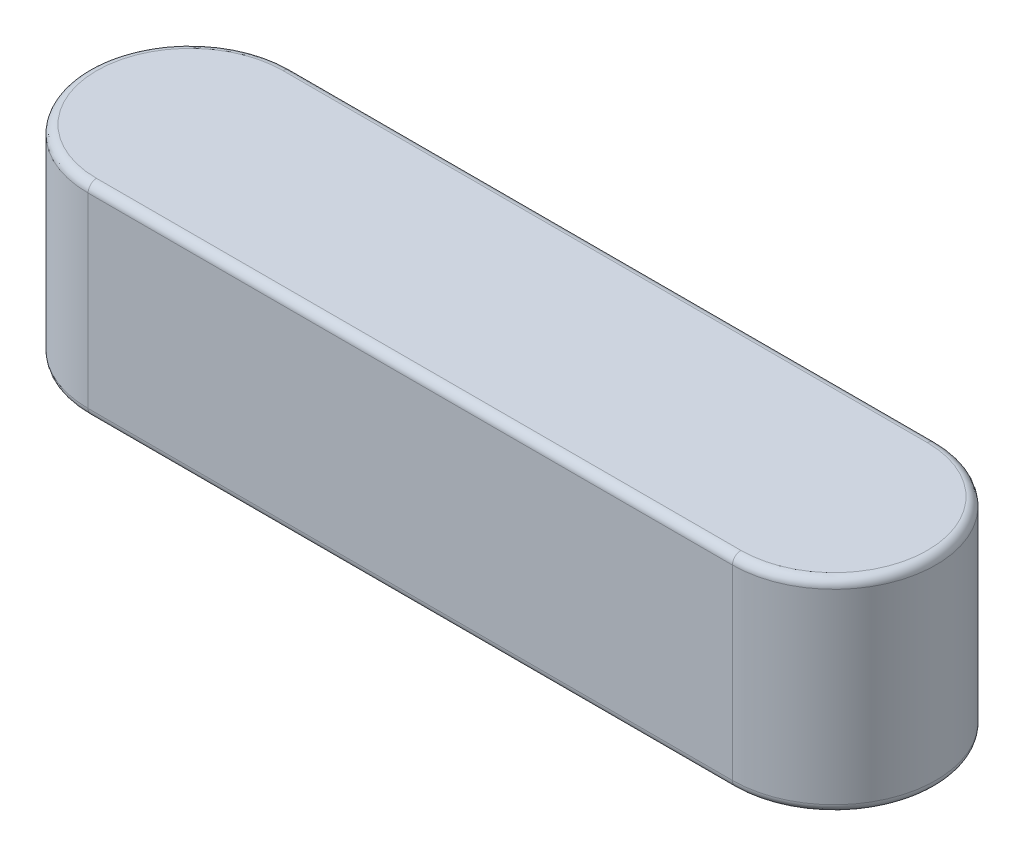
ISO-10303-21;
HEADER;
FILE_DESCRIPTION(('STEP AP214'),'2;1');
FILE_NAME('part.step','',(''),(''),'','','');
FILE_SCHEMA(('AUTOMOTIVE_DESIGN { 1 0 10303 214 1 1 1 1 }'));
ENDSEC;
DATA;
#1=APPLICATION_CONTEXT('core data for automotive mechanical design processes');
#2=APPLICATION_PROTOCOL_DEFINITION('international standard','automotive_design',2000,#1);
#3=PRODUCT_CONTEXT('',#1,'mechanical');
#4=PRODUCT('Part','Part','',(#3));
#5=PRODUCT_RELATED_PRODUCT_CATEGORY('part','',(#4));
#6=PRODUCT_DEFINITION_FORMATION('','',#4);
#7=PRODUCT_DEFINITION_CONTEXT('part definition',#1,'design');
#8=PRODUCT_DEFINITION('design','',#6,#7);
#9=PRODUCT_DEFINITION_SHAPE('','',#8);
#10=(LENGTH_UNIT() NAMED_UNIT(*) SI_UNIT(.MILLI.,.METRE.));
#11=(NAMED_UNIT(*) PLANE_ANGLE_UNIT() SI_UNIT($,.RADIAN.));
#12=(NAMED_UNIT(*) SI_UNIT($,.STERADIAN.) SOLID_ANGLE_UNIT());
#13=UNCERTAINTY_MEASURE_WITH_UNIT(LENGTH_MEASURE(1.E-05),#10,'distance_accuracy_value','');
#14=(GEOMETRIC_REPRESENTATION_CONTEXT(3) GLOBAL_UNCERTAINTY_ASSIGNED_CONTEXT((#13)) GLOBAL_UNIT_ASSIGNED_CONTEXT((#10,
#11,#12)) REPRESENTATION_CONTEXT('',''));
#15=CARTESIAN_POINT('',(0.,0.,0.));
#16=DIRECTION('',(0.,0.,1.));
#17=DIRECTION('',(1.,0.,0.));
#18=AXIS2_PLACEMENT_3D('',#15,#16,#17);
#19=CARTESIAN_POINT('',(-19.,6.,0.));
#20=DIRECTION('',(0.,-1.,0.));
#21=DIRECTION('',(0.,0.,-1.));
#22=AXIS2_PLACEMENT_3D('',#19,#20,#21);
#23=CYLINDRICAL_SURFACE('',#22,3.);
#24=DIRECTION('',(0.,-1.,0.));
#25=VECTOR('',#24,1.);
#26=CARTESIAN_POINT('',(-19.,6.,-3.));
#27=LINE('',#26,#25);
#28=CARTESIAN_POINT('',(-19.,5.75,-3.));
#29=VERTEX_POINT('',#28);
#30=CARTESIAN_POINT('',(-19.,0.25,-3.));
#31=VERTEX_POINT('',#30);
#32=EDGE_CURVE('E109',#29,#31,#27,.T.);
#33=ORIENTED_EDGE('',*,*,#32,.T.);
#34=CARTESIAN_POINT('',(-19.,0.25,0.));
#35=DIRECTION('',(0.,1.,0.));
#36=DIRECTION('',(0.,0.,1.));
#37=AXIS2_PLACEMENT_3D('',#34,#35,#36);
#38=CIRCLE('',#37,3.);
#39=CARTESIAN_POINT('',(-19.,0.25,3.));
#40=VERTEX_POINT('',#39);
#41=EDGE_CURVE('E120',#31,#40,#38,.T.);
#42=ORIENTED_EDGE('',*,*,#41,.T.);
#43=DIRECTION('',(0.,-1.,0.));
#44=VECTOR('',#43,1.);
#45=CARTESIAN_POINT('',(-19.,6.,3.));
#46=LINE('',#45,#44);
#47=CARTESIAN_POINT('',(-19.,5.75,3.));
#48=VERTEX_POINT('',#47);
#49=EDGE_CURVE('E115',#48,#40,#46,.T.);
#50=ORIENTED_EDGE('',*,*,#49,.F.);
#51=CARTESIAN_POINT('',(-19.,5.75,0.));
#52=DIRECTION('',(0.,1.,0.));
#53=DIRECTION('',(0.,0.,1.));
#54=AXIS2_PLACEMENT_3D('',#51,#52,#53);
#55=CIRCLE('',#54,3.);
#56=EDGE_CURVE('E108',#48,#29,#55,.F.);
#57=ORIENTED_EDGE('',*,*,#56,.T.);
#58=EDGE_LOOP('',(#33,#42,#50,#57));
#59=FACE_BOUND('',#58,.T.);
#60=ADVANCED_FACE('F39',(#59),#23,.T.);
#61=CARTESIAN_POINT('',(-19.,6.,3.));
#62=DIRECTION('',(0.,0.,-1.));
#63=DIRECTION('',(-1.,0.,0.));
#64=AXIS2_PLACEMENT_3D('',#61,#62,#63);
#65=PLANE('',#64);
#66=ORIENTED_EDGE('',*,*,#49,.T.);
#67=DIRECTION('',(1.,0.,0.));
#68=VECTOR('',#67,1.);
#69=CARTESIAN_POINT('',(-19.,0.25,3.));
#70=LINE('',#69,#68);
#71=CARTESIAN_POINT('',(0.,0.25,3.));
#72=VERTEX_POINT('',#71);
#73=EDGE_CURVE('E163',#40,#72,#70,.T.);
#74=ORIENTED_EDGE('',*,*,#73,.T.);
#75=DIRECTION('',(0.,-1.,0.));
#76=VECTOR('',#75,1.);
#77=CARTESIAN_POINT('',(0.,6.,3.));
#78=LINE('',#77,#76);
#79=CARTESIAN_POINT('',(0.,5.75,3.));
#80=VERTEX_POINT('',#79);
#81=EDGE_CURVE('E145',#80,#72,#78,.T.);
#82=ORIENTED_EDGE('',*,*,#81,.F.);
#83=DIRECTION('',(1.,0.,0.));
#84=VECTOR('',#83,1.);
#85=CARTESIAN_POINT('',(-19.,5.75,3.));
#86=LINE('',#85,#84);
#87=EDGE_CURVE('E156',#80,#48,#86,.F.);
#88=ORIENTED_EDGE('',*,*,#87,.T.);
#89=EDGE_LOOP('',(#66,#74,#82,#88));
#90=FACE_BOUND('',#89,.T.);
#91=ADVANCED_FACE('F190',(#90),#65,.F.);
#92=CARTESIAN_POINT('',(0.,6.,0.));
#93=DIRECTION('',(0.,-1.,0.));
#94=DIRECTION('',(0.,0.,-1.));
#95=AXIS2_PLACEMENT_3D('',#92,#93,#94);
#96=CYLINDRICAL_SURFACE('',#95,3.);
#97=ORIENTED_EDGE('',*,*,#81,.T.);
#98=CARTESIAN_POINT('',(0.,0.25,0.));
#99=DIRECTION('',(0.,1.,0.));
#100=DIRECTION('',(0.,0.,1.));
#101=AXIS2_PLACEMENT_3D('',#98,#99,#100);
#102=CIRCLE('',#101,3.);
#103=CARTESIAN_POINT('',(0.,0.25,-3.));
#104=VERTEX_POINT('',#103);
#105=EDGE_CURVE('E117',#72,#104,#102,.T.);
#106=ORIENTED_EDGE('',*,*,#105,.T.);
#107=DIRECTION('',(0.,-1.,0.));
#108=VECTOR('',#107,1.);
#109=CARTESIAN_POINT('',(0.,6.,-3.));
#110=LINE('',#109,#108);
#111=CARTESIAN_POINT('',(0.,5.75,-3.));
#112=VERTEX_POINT('',#111);
#113=EDGE_CURVE('E128',#112,#104,#110,.T.);
#114=ORIENTED_EDGE('',*,*,#113,.F.);
#115=CARTESIAN_POINT('',(0.,5.75,0.));
#116=DIRECTION('',(0.,1.,0.));
#117=DIRECTION('',(0.,0.,1.));
#118=AXIS2_PLACEMENT_3D('',#115,#116,#117);
#119=CIRCLE('',#118,3.);
#120=EDGE_CURVE('E154',#112,#80,#119,.F.);
#121=ORIENTED_EDGE('',*,*,#120,.T.);
#122=EDGE_LOOP('',(#97,#106,#114,#121));
#123=FACE_BOUND('',#122,.T.);
#124=ADVANCED_FACE('F184',(#123),#96,.T.);
#125=CARTESIAN_POINT('',(-19.,6.,-3.));
#126=DIRECTION('',(0.,0.,1.));
#127=DIRECTION('',(1.,0.,0.));
#128=AXIS2_PLACEMENT_3D('',#125,#126,#127);
#129=PLANE('',#128);
#130=ORIENTED_EDGE('',*,*,#113,.T.);
#131=DIRECTION('',(-1.,0.,0.));
#132=VECTOR('',#131,1.);
#133=CARTESIAN_POINT('',(-19.,0.25,-3.));
#134=LINE('',#133,#132);
#135=EDGE_CURVE('E127',#104,#31,#134,.T.);
#136=ORIENTED_EDGE('',*,*,#135,.T.);
#137=ORIENTED_EDGE('',*,*,#32,.F.);
#138=DIRECTION('',(-1.,0.,0.));
#139=VECTOR('',#138,1.);
#140=CARTESIAN_POINT('',(0.,5.75,-3.));
#141=LINE('',#140,#139);
#142=EDGE_CURVE('E123',#29,#112,#141,.F.);
#143=ORIENTED_EDGE('',*,*,#142,.T.);
#144=EDGE_LOOP('',(#130,#136,#137,#143));
#145=FACE_BOUND('',#144,.T.);
#146=ADVANCED_FACE('F124',(#145),#129,.F.);
#147=CARTESIAN_POINT('',(-19.,6.,0.));
#148=DIRECTION('',(0.,1.,0.));
#149=DIRECTION('',(0.,0.,1.));
#150=AXIS2_PLACEMENT_3D('',#147,#148,#149);
#151=PLANE('',#150);
#152=DIRECTION('',(1.,0.,0.));
#153=VECTOR('',#152,1.);
#154=CARTESIAN_POINT('',(0.,6.,2.75));
#155=LINE('',#154,#153);
#156=CARTESIAN_POINT('',(-19.,6.,2.75));
#157=VERTEX_POINT('',#156);
#158=CARTESIAN_POINT('',(0.,6.,2.75));
#159=VERTEX_POINT('',#158);
#160=EDGE_CURVE('E48',#157,#159,#155,.T.);
#161=ORIENTED_EDGE('',*,*,#160,.T.);
#162=CARTESIAN_POINT('',(0.,6.,0.));
#163=DIRECTION('',(0.,1.,0.));
#164=DIRECTION('',(0.,0.,1.));
#165=AXIS2_PLACEMENT_3D('',#162,#163,#164);
#166=CIRCLE('',#165,2.75);
#167=CARTESIAN_POINT('',(0.,6.,-2.75));
#168=VERTEX_POINT('',#167);
#169=EDGE_CURVE('E11',#159,#168,#166,.T.);
#170=ORIENTED_EDGE('',*,*,#169,.T.);
#171=DIRECTION('',(-1.,0.,0.));
#172=VECTOR('',#171,1.);
#173=CARTESIAN_POINT('',(-19.,6.,-2.75));
#174=LINE('',#173,#172);
#175=CARTESIAN_POINT('',(-19.,6.,-2.75));
#176=VERTEX_POINT('',#175);
#177=EDGE_CURVE('E165',#168,#176,#174,.T.);
#178=ORIENTED_EDGE('',*,*,#177,.T.);
#179=CARTESIAN_POINT('',(-19.,6.,0.));
#180=DIRECTION('',(0.,1.,0.));
#181=DIRECTION('',(0.,0.,1.));
#182=AXIS2_PLACEMENT_3D('',#179,#180,#181);
#183=CIRCLE('',#182,2.75);
#184=EDGE_CURVE('E132',#176,#157,#183,.T.);
#185=ORIENTED_EDGE('',*,*,#184,.T.);
#186=EDGE_LOOP('',(#161,#170,#178,#185));
#187=FACE_BOUND('',#186,.T.);
#188=ADVANCED_FACE('F208',(#187),#151,.T.);
#189=CARTESIAN_POINT('',(-19.,0.,0.));
#190=DIRECTION('',(0.,1.,0.));
#191=DIRECTION('',(0.,0.,1.));
#192=AXIS2_PLACEMENT_3D('',#189,#190,#191);
#193=PLANE('',#192);
#194=CARTESIAN_POINT('',(-19.,0.,0.));
#195=DIRECTION('',(0.,1.,0.));
#196=DIRECTION('',(0.,0.,1.));
#197=AXIS2_PLACEMENT_3D('',#194,#195,#196);
#198=CIRCLE('',#197,2.75);
#199=CARTESIAN_POINT('',(-19.,0.,2.75));
#200=VERTEX_POINT('',#199);
#201=CARTESIAN_POINT('',(-19.,0.,-2.75));
#202=VERTEX_POINT('',#201);
#203=EDGE_CURVE('E150',#200,#202,#198,.F.);
#204=ORIENTED_EDGE('',*,*,#203,.T.);
#205=DIRECTION('',(-1.,0.,0.));
#206=VECTOR('',#205,1.);
#207=CARTESIAN_POINT('',(-19.,0.,-2.75));
#208=LINE('',#207,#206);
#209=CARTESIAN_POINT('',(0.,0.,-2.75));
#210=VERTEX_POINT('',#209);
#211=EDGE_CURVE('E153',#202,#210,#208,.F.);
#212=ORIENTED_EDGE('',*,*,#211,.T.);
#213=CARTESIAN_POINT('',(0.,0.,0.));
#214=DIRECTION('',(0.,1.,0.));
#215=DIRECTION('',(0.,0.,1.));
#216=AXIS2_PLACEMENT_3D('',#213,#214,#215);
#217=CIRCLE('',#216,2.75);
#218=CARTESIAN_POINT('',(0.,0.,2.75));
#219=VERTEX_POINT('',#218);
#220=EDGE_CURVE('E148',#210,#219,#217,.F.);
#221=ORIENTED_EDGE('',*,*,#220,.T.);
#222=DIRECTION('',(1.,0.,0.));
#223=VECTOR('',#222,1.);
#224=CARTESIAN_POINT('',(-19.,0.,2.75));
#225=LINE('',#224,#223);
#226=EDGE_CURVE('E138',#219,#200,#225,.F.);
#227=ORIENTED_EDGE('',*,*,#226,.T.);
#228=EDGE_LOOP('',(#204,#212,#221,#227));
#229=FACE_BOUND('',#228,.T.);
#230=ADVANCED_FACE('F206',(#229),#193,.F.);
#231=CARTESIAN_POINT('',(-19.,0.25,2.75));
#232=DIRECTION('',(1.,0.,0.));
#233=DIRECTION('',(0.,0.,-1.));
#234=AXIS2_PLACEMENT_3D('',#231,#232,#233);
#235=CYLINDRICAL_SURFACE('',#234,0.25);
#236=CARTESIAN_POINT('',(-19.,0.25,2.75));
#237=DIRECTION('',(-1.,0.,0.));
#238=DIRECTION('',(0.,0.,1.));
#239=AXIS2_PLACEMENT_3D('',#236,#237,#238);
#240=CIRCLE('',#239,0.25);
#241=EDGE_CURVE('E171',#200,#40,#240,.T.);
#242=ORIENTED_EDGE('',*,*,#241,.F.);
#243=ORIENTED_EDGE('',*,*,#226,.F.);
#244=CARTESIAN_POINT('',(0.,0.25,2.75));
#245=DIRECTION('',(1.,0.,0.));
#246=DIRECTION('',(0.,0.,-1.));
#247=AXIS2_PLACEMENT_3D('',#244,#245,#246);
#248=CIRCLE('',#247,0.25);
#249=EDGE_CURVE('E129',#72,#219,#248,.T.);
#250=ORIENTED_EDGE('',*,*,#249,.F.);
#251=ORIENTED_EDGE('',*,*,#73,.F.);
#252=EDGE_LOOP('',(#242,#243,#250,#251));
#253=FACE_BOUND('',#252,.T.);
#254=ADVANCED_FACE('F203',(#253),#235,.T.);
#255=CARTESIAN_POINT('',(0.,0.25,0.));
#256=DIRECTION('',(0.,1.,0.));
#257=DIRECTION('',(0.,0.,1.));
#258=AXIS2_PLACEMENT_3D('',#255,#256,#257);
#259=TOROIDAL_SURFACE('',#258,2.75,0.25);
#260=ORIENTED_EDGE('',*,*,#249,.T.);
#261=ORIENTED_EDGE('',*,*,#220,.F.);
#262=CARTESIAN_POINT('',(0.,0.25,-2.75));
#263=DIRECTION('',(-1.,0.,0.));
#264=DIRECTION('',(0.,0.,1.));
#265=AXIS2_PLACEMENT_3D('',#262,#263,#264);
#266=CIRCLE('',#265,0.25);
#267=EDGE_CURVE('E169',#104,#210,#266,.T.);
#268=ORIENTED_EDGE('',*,*,#267,.F.);
#269=ORIENTED_EDGE('',*,*,#105,.F.);
#270=EDGE_LOOP('',(#260,#261,#268,#269));
#271=FACE_BOUND('',#270,.T.);
#272=ADVANCED_FACE('F193',(#271),#259,.T.);
#273=CARTESIAN_POINT('',(-19.,0.25,0.));
#274=DIRECTION('',(0.,1.,0.));
#275=DIRECTION('',(0.,0.,1.));
#276=AXIS2_PLACEMENT_3D('',#273,#274,#275);
#277=TOROIDAL_SURFACE('',#276,2.75,0.25);
#278=ORIENTED_EDGE('',*,*,#241,.T.);
#279=ORIENTED_EDGE('',*,*,#41,.F.);
#280=CARTESIAN_POINT('',(-19.,0.25,-2.75));
#281=DIRECTION('',(1.,0.,0.));
#282=DIRECTION('',(0.,0.,-1.));
#283=AXIS2_PLACEMENT_3D('',#280,#281,#282);
#284=CIRCLE('',#283,0.25);
#285=EDGE_CURVE('E170',#202,#31,#284,.T.);
#286=ORIENTED_EDGE('',*,*,#285,.F.);
#287=ORIENTED_EDGE('',*,*,#203,.F.);
#288=EDGE_LOOP('',(#278,#279,#286,#287));
#289=FACE_BOUND('',#288,.T.);
#290=ADVANCED_FACE('F205',(#289),#277,.T.);
#291=CARTESIAN_POINT('',(-19.,0.25,-2.75));
#292=DIRECTION('',(-1.,0.,0.));
#293=DIRECTION('',(0.,0.,1.));
#294=AXIS2_PLACEMENT_3D('',#291,#292,#293);
#295=CYLINDRICAL_SURFACE('',#294,0.25);
#296=ORIENTED_EDGE('',*,*,#267,.T.);
#297=ORIENTED_EDGE('',*,*,#211,.F.);
#298=ORIENTED_EDGE('',*,*,#285,.T.);
#299=ORIENTED_EDGE('',*,*,#135,.F.);
#300=EDGE_LOOP('',(#296,#297,#298,#299));
#301=FACE_BOUND('',#300,.T.);
#302=ADVANCED_FACE('F200',(#301),#295,.T.);
#303=CARTESIAN_POINT('',(-19.,5.75,0.));
#304=DIRECTION('',(0.,1.,0.));
#305=DIRECTION('',(0.,0.,1.));
#306=AXIS2_PLACEMENT_3D('',#303,#304,#305);
#307=TOROIDAL_SURFACE('',#306,2.75,0.25);
#308=CARTESIAN_POINT('',(-19.,5.75,-2.75));
#309=DIRECTION('',(1.,0.,0.));
#310=DIRECTION('',(0.,0.,-1.));
#311=AXIS2_PLACEMENT_3D('',#308,#309,#310);
#312=CIRCLE('',#311,0.25);
#313=EDGE_CURVE('E134',#29,#176,#312,.T.);
#314=ORIENTED_EDGE('',*,*,#313,.F.);
#315=ORIENTED_EDGE('',*,*,#56,.F.);
#316=CARTESIAN_POINT('',(-19.,5.75,2.75));
#317=DIRECTION('',(1.,0.,0.));
#318=DIRECTION('',(0.,0.,-1.));
#319=AXIS2_PLACEMENT_3D('',#316,#317,#318);
#320=CIRCLE('',#319,0.25);
#321=EDGE_CURVE('E43',#157,#48,#320,.T.);
#322=ORIENTED_EDGE('',*,*,#321,.F.);
#323=ORIENTED_EDGE('',*,*,#184,.F.);
#324=EDGE_LOOP('',(#314,#315,#322,#323));
#325=FACE_BOUND('',#324,.T.);
#326=ADVANCED_FACE('F41',(#325),#307,.T.);
#327=CARTESIAN_POINT('',(-19.,5.75,2.75));
#328=DIRECTION('',(-1.,0.,0.));
#329=DIRECTION('',(0.,0.,1.));
#330=AXIS2_PLACEMENT_3D('',#327,#328,#329);
#331=CYLINDRICAL_SURFACE('',#330,0.25);
#332=ORIENTED_EDGE('',*,*,#321,.T.);
#333=ORIENTED_EDGE('',*,*,#87,.F.);
#334=CARTESIAN_POINT('',(0.,5.75,2.75));
#335=DIRECTION('',(1.,0.,0.));
#336=DIRECTION('',(0.,0.,-1.));
#337=AXIS2_PLACEMENT_3D('',#334,#335,#336);
#338=CIRCLE('',#337,0.25);
#339=EDGE_CURVE('E140',#159,#80,#338,.T.);
#340=ORIENTED_EDGE('',*,*,#339,.F.);
#341=ORIENTED_EDGE('',*,*,#160,.F.);
#342=EDGE_LOOP('',(#332,#333,#340,#341));
#343=FACE_BOUND('',#342,.T.);
#344=ADVANCED_FACE('F179',(#343),#331,.T.);
#345=CARTESIAN_POINT('',(-19.,5.75,-2.75));
#346=DIRECTION('',(1.,0.,0.));
#347=DIRECTION('',(0.,0.,-1.));
#348=AXIS2_PLACEMENT_3D('',#345,#346,#347);
#349=CYLINDRICAL_SURFACE('',#348,0.25);
#350=ORIENTED_EDGE('',*,*,#313,.T.);
#351=ORIENTED_EDGE('',*,*,#177,.F.);
#352=CARTESIAN_POINT('',(0.,5.75,-2.75));
#353=DIRECTION('',(1.,0.,0.));
#354=DIRECTION('',(0.,0.,-1.));
#355=AXIS2_PLACEMENT_3D('',#352,#353,#354);
#356=CIRCLE('',#355,0.25);
#357=EDGE_CURVE('E65',#112,#168,#356,.T.);
#358=ORIENTED_EDGE('',*,*,#357,.F.);
#359=ORIENTED_EDGE('',*,*,#142,.F.);
#360=EDGE_LOOP('',(#350,#351,#358,#359));
#361=FACE_BOUND('',#360,.T.);
#362=ADVANCED_FACE('F139',(#361),#349,.T.);
#363=CARTESIAN_POINT('',(0.,5.75,0.));
#364=DIRECTION('',(0.,1.,0.));
#365=DIRECTION('',(0.,0.,1.));
#366=AXIS2_PLACEMENT_3D('',#363,#364,#365);
#367=TOROIDAL_SURFACE('',#366,2.75,0.25);
#368=ORIENTED_EDGE('',*,*,#339,.T.);
#369=ORIENTED_EDGE('',*,*,#120,.F.);
#370=ORIENTED_EDGE('',*,*,#357,.T.);
#371=ORIENTED_EDGE('',*,*,#169,.F.);
#372=EDGE_LOOP('',(#368,#369,#370,#371));
#373=FACE_BOUND('',#372,.T.);
#374=ADVANCED_FACE('F178',(#373),#367,.T.);
#375=CLOSED_SHELL('',(#60,#91,#124,#146,#188,#230,#254,#272,#290,#302,#326,#344,#362,#374));
#376=MANIFOLD_SOLID_BREP('B2',#375);
#377=ADVANCED_BREP_SHAPE_REPRESENTATION('',(#18,#376),#14);
#378=SHAPE_DEFINITION_REPRESENTATION(#9,#377);
ENDSEC;
END-ISO-10303-21;
